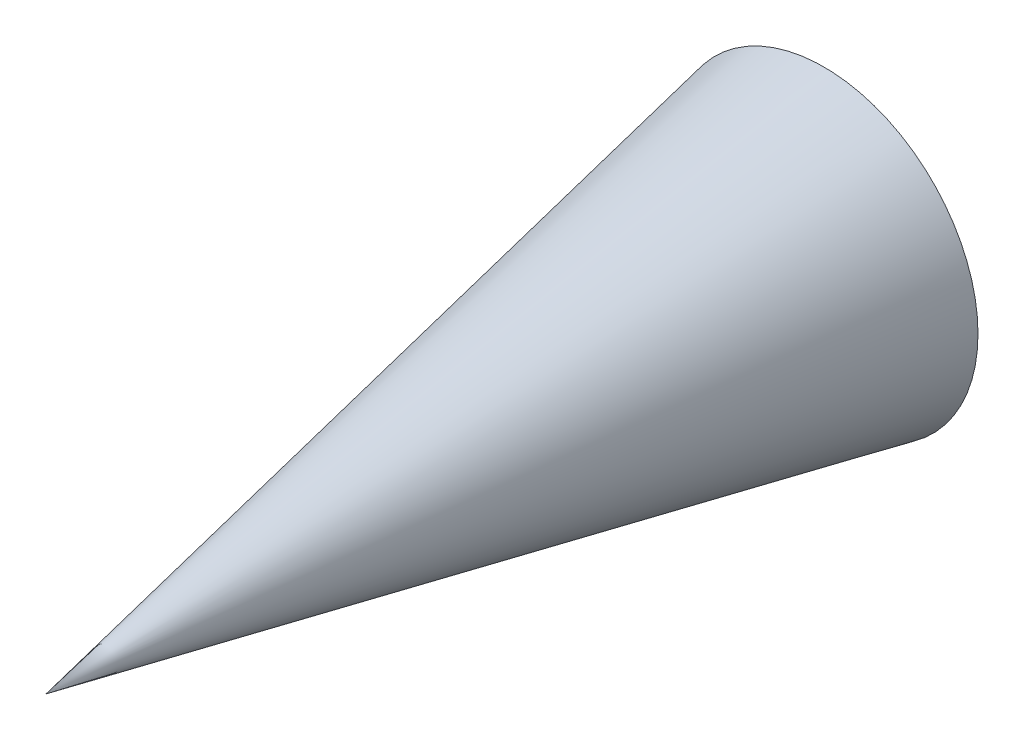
ISO-10303-21;
HEADER;
FILE_DESCRIPTION(('STEP AP214'),'2;1');
FILE_NAME('part.step','',(''),(''),'','','');
FILE_SCHEMA(('AUTOMOTIVE_DESIGN { 1 0 10303 214 1 1 1 1 }'));
ENDSEC;
DATA;
#1=APPLICATION_CONTEXT('core data for automotive mechanical design processes');
#2=APPLICATION_PROTOCOL_DEFINITION('international standard','automotive_design',2000,#1);
#3=PRODUCT_CONTEXT('',#1,'mechanical');
#4=PRODUCT('Part','Part','',(#3));
#5=PRODUCT_RELATED_PRODUCT_CATEGORY('part','',(#4));
#6=PRODUCT_DEFINITION_FORMATION('','',#4);
#7=PRODUCT_DEFINITION_CONTEXT('part definition',#1,'design');
#8=PRODUCT_DEFINITION('design','',#6,#7);
#9=PRODUCT_DEFINITION_SHAPE('','',#8);
#10=(LENGTH_UNIT() NAMED_UNIT(*) SI_UNIT(.MILLI.,.METRE.));
#11=(NAMED_UNIT(*) PLANE_ANGLE_UNIT() SI_UNIT($,.RADIAN.));
#12=(NAMED_UNIT(*) SI_UNIT($,.STERADIAN.) SOLID_ANGLE_UNIT());
#13=UNCERTAINTY_MEASURE_WITH_UNIT(LENGTH_MEASURE(1.E-05),#10,'distance_accuracy_value','');
#14=(GEOMETRIC_REPRESENTATION_CONTEXT(3) GLOBAL_UNCERTAINTY_ASSIGNED_CONTEXT((#13)) GLOBAL_UNIT_ASSIGNED_CONTEXT((#10,
#11,#12)) REPRESENTATION_CONTEXT('',''));
#15=CARTESIAN_POINT('',(0.,0.,0.));
#16=DIRECTION('',(0.,0.,1.));
#17=DIRECTION('',(1.,0.,0.));
#18=AXIS2_PLACEMENT_3D('',#15,#16,#17);
#19=CARTESIAN_POINT('',(0.,0.,-125.));
#20=DIRECTION('',(0.,0.,1.));
#21=DIRECTION('',(1.,0.,0.));
#22=AXIS2_PLACEMENT_3D('',#19,#20,#21);
#23=PLANE('',#22);
#24=CARTESIAN_POINT('',(0.,0.,-125.));
#25=DIRECTION('',(0.,0.,1.));
#26=DIRECTION('',(1.,0.,0.));
#27=AXIS2_PLACEMENT_3D('',#24,#25,#26);
#28=CIRCLE('',#27,24.76);
#29=CARTESIAN_POINT('',(24.76,0.,-125.));
#30=VERTEX_POINT('',#29);
#31=EDGE_CURVE('E11',#30,#30,#28,.T.);
#32=ORIENTED_EDGE('',*,*,#31,.F.);
#33=EDGE_LOOP('',(#32));
#34=FACE_BOUND('',#33,.T.);
#35=ADVANCED_FACE('F34',(#34),#23,.F.);
#36=CARTESIAN_POINT('',(0.,0.,-125.));
#37=DIRECTION('',(0.,0.,-1.));
#38=DIRECTION('',(-1.,0.,0.));
#39=AXIS2_PLACEMENT_3D('',#36,#37,#38);
#40=CONICAL_SURFACE('',#39,24.76,0.195548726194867);
#41=CARTESIAN_POINT('',(0.,0.,0.));
#42=VERTEX_POINT('',#41);
#43=VERTEX_LOOP('',#42);
#44=FACE_BOUND('',#43,.T.);
#45=ORIENTED_EDGE('',*,*,#31,.T.);
#46=EDGE_LOOP('',(#45));
#47=FACE_BOUND('',#46,.T.);
#48=ADVANCED_FACE('F41',(#44,#47),#40,.T.);
#49=CLOSED_SHELL('',(#35,#48));
#50=MANIFOLD_SOLID_BREP('B2',#49);
#51=ADVANCED_BREP_SHAPE_REPRESENTATION('',(#18,#50),#14);
#52=SHAPE_DEFINITION_REPRESENTATION(#9,#51);
ENDSEC;
END-ISO-10303-21;
